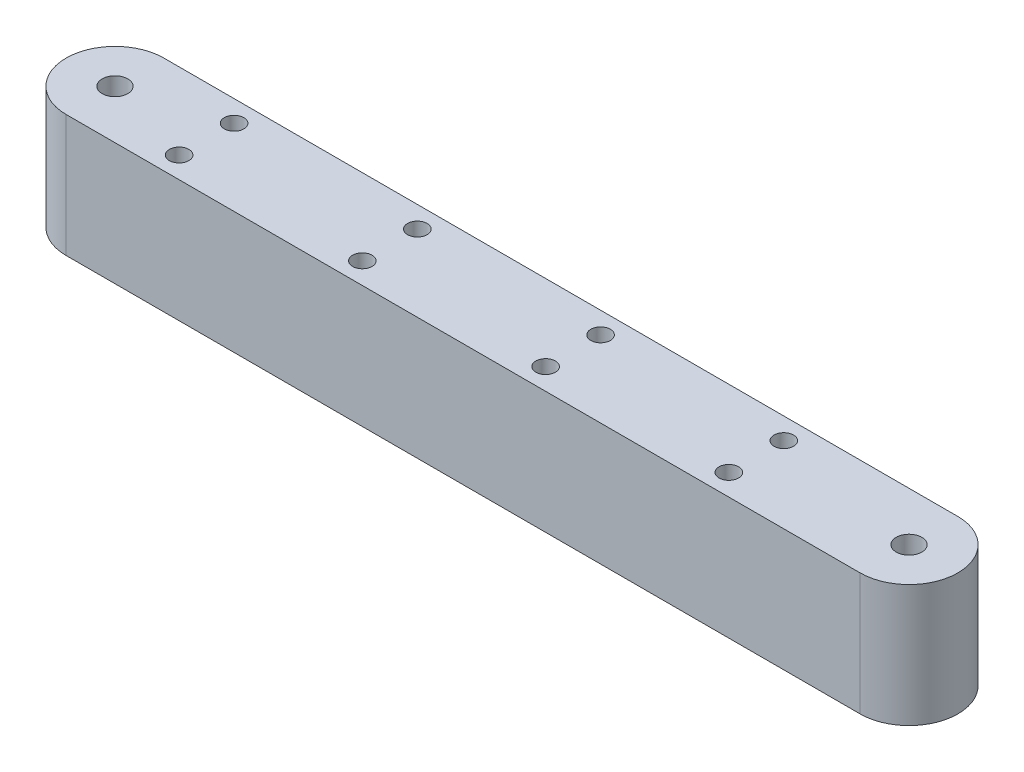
ISO-10303-21;
HEADER;
FILE_DESCRIPTION(('STEP AP214'),'2;1');
FILE_NAME('part.step','',(''),(''),'','','');
FILE_SCHEMA(('AUTOMOTIVE_DESIGN { 1 0 10303 214 1 1 1 1 }'));
ENDSEC;
DATA;
#1=APPLICATION_CONTEXT('core data for automotive mechanical design processes');
#2=APPLICATION_PROTOCOL_DEFINITION('international standard','automotive_design',2000,#1);
#3=PRODUCT_CONTEXT('',#1,'mechanical');
#4=PRODUCT('Part','Part','',(#3));
#5=PRODUCT_RELATED_PRODUCT_CATEGORY('part','',(#4));
#6=PRODUCT_DEFINITION_FORMATION('','',#4);
#7=PRODUCT_DEFINITION_CONTEXT('part definition',#1,'design');
#8=PRODUCT_DEFINITION('design','',#6,#7);
#9=PRODUCT_DEFINITION_SHAPE('','',#8);
#10=(LENGTH_UNIT() NAMED_UNIT(*) SI_UNIT(.MILLI.,.METRE.));
#11=(NAMED_UNIT(*) PLANE_ANGLE_UNIT() SI_UNIT($,.RADIAN.));
#12=(NAMED_UNIT(*) SI_UNIT($,.STERADIAN.) SOLID_ANGLE_UNIT());
#13=UNCERTAINTY_MEASURE_WITH_UNIT(LENGTH_MEASURE(1.E-05),#10,'distance_accuracy_value','');
#14=(GEOMETRIC_REPRESENTATION_CONTEXT(3) GLOBAL_UNCERTAINTY_ASSIGNED_CONTEXT((#13)) GLOBAL_UNIT_ASSIGNED_CONTEXT((#10,
#11,#12)) REPRESENTATION_CONTEXT('',''));
#15=CARTESIAN_POINT('',(0.,0.,0.));
#16=DIRECTION('',(0.,0.,1.));
#17=DIRECTION('',(1.,0.,0.));
#18=AXIS2_PLACEMENT_3D('',#15,#16,#17);
#19=CARTESIAN_POINT('',(-65.,20.,0.));
#20=DIRECTION('',(0.,1.,0.));
#21=DIRECTION('',(0.,0.,1.));
#22=AXIS2_PLACEMENT_3D('',#19,#20,#21);
#23=PLANE('',#22);
#24=CARTESIAN_POINT('',(-19.9999999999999,20.,4.49999999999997));
#25=DIRECTION('',(0.,1.,0.));
#26=DIRECTION('',(0.,0.,1.));
#27=AXIS2_PLACEMENT_3D('',#24,#25,#26);
#28=CIRCLE('',#27,1.6);
#29=CARTESIAN_POINT('',(-19.9999999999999,20.,6.09999999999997));
#30=VERTEX_POINT('',#29);
#31=EDGE_CURVE('E153',#30,#30,#28,.T.);
#32=ORIENTED_EDGE('',*,*,#31,.F.);
#33=EDGE_LOOP('',(#32));
#34=FACE_BOUND('',#33,.T.);
#35=CARTESIAN_POINT('',(40.,20.,-4.50000000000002));
#36=DIRECTION('',(0.,1.,0.));
#37=DIRECTION('',(0.,0.,1.));
#38=AXIS2_PLACEMENT_3D('',#35,#36,#37);
#39=CIRCLE('',#38,1.59999999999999);
#40=CARTESIAN_POINT('',(40.,20.,-2.90000000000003));
#41=VERTEX_POINT('',#40);
#42=EDGE_CURVE('E142',#41,#41,#39,.T.);
#43=ORIENTED_EDGE('',*,*,#42,.F.);
#44=EDGE_LOOP('',(#43));
#45=FACE_BOUND('',#44,.T.);
#46=CARTESIAN_POINT('',(9.99999999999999,20.,-4.50000000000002));
#47=DIRECTION('',(0.,1.,0.));
#48=DIRECTION('',(0.,0.,1.));
#49=AXIS2_PLACEMENT_3D('',#46,#47,#48);
#50=CIRCLE('',#49,1.6);
#51=CARTESIAN_POINT('',(9.99999999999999,20.,-2.90000000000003));
#52=VERTEX_POINT('',#51);
#53=EDGE_CURVE('E141',#52,#52,#50,.T.);
#54=ORIENTED_EDGE('',*,*,#53,.F.);
#55=EDGE_LOOP('',(#54));
#56=FACE_BOUND('',#55,.T.);
#57=CARTESIAN_POINT('',(-20.,20.,-4.50000000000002));
#58=DIRECTION('',(0.,1.,0.));
#59=DIRECTION('',(0.,0.,1.));
#60=AXIS2_PLACEMENT_3D('',#57,#58,#59);
#61=CIRCLE('',#60,1.6);
#62=CARTESIAN_POINT('',(-20.,20.,-2.90000000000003));
#63=VERTEX_POINT('',#62);
#64=EDGE_CURVE('E135',#63,#63,#61,.T.);
#65=ORIENTED_EDGE('',*,*,#64,.F.);
#66=EDGE_LOOP('',(#65));
#67=FACE_BOUND('',#66,.T.);
#68=CARTESIAN_POINT('',(10.0000000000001,20.,4.49999999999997));
#69=DIRECTION('',(0.,1.,0.));
#70=DIRECTION('',(0.,0.,1.));
#71=AXIS2_PLACEMENT_3D('',#68,#69,#70);
#72=CIRCLE('',#71,1.6);
#73=CARTESIAN_POINT('',(10.0000000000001,20.,6.09999999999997));
#74=VERTEX_POINT('',#73);
#75=EDGE_CURVE('E154',#74,#74,#72,.T.);
#76=ORIENTED_EDGE('',*,*,#75,.F.);
#77=EDGE_LOOP('',(#76));
#78=FACE_BOUND('',#77,.T.);
#79=CARTESIAN_POINT('',(40.0000000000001,20.,4.49999999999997));
#80=DIRECTION('',(0.,1.,0.));
#81=DIRECTION('',(0.,0.,1.));
#82=AXIS2_PLACEMENT_3D('',#79,#80,#81);
#83=CIRCLE('',#82,1.60000000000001);
#84=CARTESIAN_POINT('',(40.0000000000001,20.,6.09999999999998));
#85=VERTEX_POINT('',#84);
#86=EDGE_CURVE('E171',#85,#85,#83,.T.);
#87=ORIENTED_EDGE('',*,*,#86,.F.);
#88=EDGE_LOOP('',(#87));
#89=FACE_BOUND('',#88,.T.);
#90=CARTESIAN_POINT('',(-49.9999999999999,20.,4.49999999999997));
#91=DIRECTION('',(0.,1.,0.));
#92=DIRECTION('',(0.,0.,1.));
#93=AXIS2_PLACEMENT_3D('',#90,#91,#92);
#94=CIRCLE('',#93,1.6);
#95=CARTESIAN_POINT('',(-49.9999999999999,20.,6.09999999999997));
#96=VERTEX_POINT('',#95);
#97=EDGE_CURVE('E165',#96,#96,#94,.T.);
#98=ORIENTED_EDGE('',*,*,#97,.F.);
#99=EDGE_LOOP('',(#98));
#100=FACE_BOUND('',#99,.T.);
#101=CARTESIAN_POINT('',(-50.,20.,-4.50000000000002));
#102=DIRECTION('',(0.,1.,0.));
#103=DIRECTION('',(0.,0.,1.));
#104=AXIS2_PLACEMENT_3D('',#101,#102,#103);
#105=CIRCLE('',#104,1.6);
#106=CARTESIAN_POINT('',(-50.,20.,-2.90000000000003));
#107=VERTEX_POINT('',#106);
#108=EDGE_CURVE('E132',#107,#107,#105,.T.);
#109=ORIENTED_EDGE('',*,*,#108,.F.);
#110=EDGE_LOOP('',(#109));
#111=FACE_BOUND('',#110,.T.);
#112=CARTESIAN_POINT('',(-65.,20.,0.));
#113=DIRECTION('',(0.,1.,0.));
#114=DIRECTION('',(0.,0.,1.));
#115=AXIS2_PLACEMENT_3D('',#112,#113,#114);
#116=CIRCLE('',#115,2.1);
#117=CARTESIAN_POINT('',(-65.,20.,2.1));
#118=VERTEX_POINT('',#117);
#119=EDGE_CURVE('E108',#118,#118,#116,.T.);
#120=ORIENTED_EDGE('',*,*,#119,.F.);
#121=EDGE_LOOP('',(#120));
#122=FACE_BOUND('',#121,.T.);
#123=CARTESIAN_POINT('',(-65.,20.,0.));
#124=DIRECTION('',(0.,1.,0.));
#125=DIRECTION('',(0.,0.,1.));
#126=AXIS2_PLACEMENT_3D('',#123,#124,#125);
#127=CIRCLE('',#126,8.);
#128=CARTESIAN_POINT('',(-65.,20.,-8.));
#129=VERTEX_POINT('',#128);
#130=CARTESIAN_POINT('',(-65.,20.,8.));
#131=VERTEX_POINT('',#130);
#132=EDGE_CURVE('E93',#129,#131,#127,.T.);
#133=ORIENTED_EDGE('',*,*,#132,.T.);
#134=DIRECTION('',(1.,0.,0.));
#135=VECTOR('',#134,1.);
#136=CARTESIAN_POINT('',(-65.,20.,8.));
#137=LINE('',#136,#135);
#138=CARTESIAN_POINT('',(65.,20.,7.99999999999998));
#139=VERTEX_POINT('',#138);
#140=EDGE_CURVE('E88',#131,#139,#137,.T.);
#141=ORIENTED_EDGE('',*,*,#140,.T.);
#142=CARTESIAN_POINT('',(65.,20.,0.));
#143=DIRECTION('',(0.,1.,0.));
#144=DIRECTION('',(0.,0.,1.));
#145=AXIS2_PLACEMENT_3D('',#142,#143,#144);
#146=CIRCLE('',#145,8.);
#147=CARTESIAN_POINT('',(65.,20.,-8.00000000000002));
#148=VERTEX_POINT('',#147);
#149=EDGE_CURVE('E91',#139,#148,#146,.T.);
#150=ORIENTED_EDGE('',*,*,#149,.T.);
#151=DIRECTION('',(-1.,0.,0.));
#152=VECTOR('',#151,1.);
#153=CARTESIAN_POINT('',(-65.,20.,-8.));
#154=LINE('',#153,#152);
#155=EDGE_CURVE('E58',#148,#129,#154,.T.);
#156=ORIENTED_EDGE('',*,*,#155,.T.);
#157=EDGE_LOOP('',(#133,#141,#150,#156));
#158=FACE_BOUND('',#157,.T.);
#159=CARTESIAN_POINT('',(65.,20.,0.));
#160=DIRECTION('',(0.,1.,0.));
#161=DIRECTION('',(0.,0.,1.));
#162=AXIS2_PLACEMENT_3D('',#159,#160,#161);
#163=CIRCLE('',#162,2.1);
#164=CARTESIAN_POINT('',(65.,20.,2.09999999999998));
#165=VERTEX_POINT('',#164);
#166=EDGE_CURVE('E123',#165,#165,#163,.T.);
#167=ORIENTED_EDGE('',*,*,#166,.F.);
#168=EDGE_LOOP('',(#167));
#169=FACE_BOUND('',#168,.T.);
#170=ADVANCED_FACE('F41',(#34,#45,#56,#67,#78,#89,#100,#111,#122,#158,#169),#23,.T.);
#171=CARTESIAN_POINT('',(-65.,0.,0.));
#172=DIRECTION('',(0.,1.,0.));
#173=DIRECTION('',(0.,0.,1.));
#174=AXIS2_PLACEMENT_3D('',#171,#172,#173);
#175=PLANE('',#174);
#176=CARTESIAN_POINT('',(-19.9999999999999,0.,4.49999999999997));
#177=DIRECTION('',(0.,1.,0.));
#178=DIRECTION('',(0.,0.,1.));
#179=AXIS2_PLACEMENT_3D('',#176,#177,#178);
#180=CIRCLE('',#179,1.6);
#181=CARTESIAN_POINT('',(-19.9999999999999,0.,6.09999999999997));
#182=VERTEX_POINT('',#181);
#183=EDGE_CURVE('E150',#182,#182,#180,.T.);
#184=ORIENTED_EDGE('',*,*,#183,.T.);
#185=EDGE_LOOP('',(#184));
#186=FACE_BOUND('',#185,.T.);
#187=CARTESIAN_POINT('',(40.,0.,-4.50000000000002));
#188=DIRECTION('',(0.,1.,0.));
#189=DIRECTION('',(0.,0.,1.));
#190=AXIS2_PLACEMENT_3D('',#187,#188,#189);
#191=CIRCLE('',#190,1.59999999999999);
#192=CARTESIAN_POINT('',(40.,0.,-2.90000000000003));
#193=VERTEX_POINT('',#192);
#194=EDGE_CURVE('E157',#193,#193,#191,.T.);
#195=ORIENTED_EDGE('',*,*,#194,.T.);
#196=EDGE_LOOP('',(#195));
#197=FACE_BOUND('',#196,.T.);
#198=CARTESIAN_POINT('',(9.99999999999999,0.,-4.50000000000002));
#199=DIRECTION('',(0.,1.,0.));
#200=DIRECTION('',(0.,0.,1.));
#201=AXIS2_PLACEMENT_3D('',#198,#199,#200);
#202=CIRCLE('',#201,1.6);
#203=CARTESIAN_POINT('',(9.99999999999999,0.,-2.90000000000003));
#204=VERTEX_POINT('',#203);
#205=EDGE_CURVE('E138',#204,#204,#202,.T.);
#206=ORIENTED_EDGE('',*,*,#205,.T.);
#207=EDGE_LOOP('',(#206));
#208=FACE_BOUND('',#207,.T.);
#209=CARTESIAN_POINT('',(-20.,0.,-4.50000000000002));
#210=DIRECTION('',(0.,1.,0.));
#211=DIRECTION('',(0.,0.,1.));
#212=AXIS2_PLACEMENT_3D('',#209,#210,#211);
#213=CIRCLE('',#212,1.6);
#214=CARTESIAN_POINT('',(-20.,0.,-2.90000000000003));
#215=VERTEX_POINT('',#214);
#216=EDGE_CURVE('E145',#215,#215,#213,.T.);
#217=ORIENTED_EDGE('',*,*,#216,.T.);
#218=EDGE_LOOP('',(#217));
#219=FACE_BOUND('',#218,.T.);
#220=CARTESIAN_POINT('',(10.0000000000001,0.,4.49999999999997));
#221=DIRECTION('',(0.,1.,0.));
#222=DIRECTION('',(0.,0.,1.));
#223=AXIS2_PLACEMENT_3D('',#220,#221,#222);
#224=CIRCLE('',#223,1.6);
#225=CARTESIAN_POINT('',(10.0000000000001,0.,6.09999999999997));
#226=VERTEX_POINT('',#225);
#227=EDGE_CURVE('E174',#226,#226,#224,.T.);
#228=ORIENTED_EDGE('',*,*,#227,.T.);
#229=EDGE_LOOP('',(#228));
#230=FACE_BOUND('',#229,.T.);
#231=CARTESIAN_POINT('',(40.0000000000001,0.,4.49999999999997));
#232=DIRECTION('',(0.,1.,0.));
#233=DIRECTION('',(0.,0.,1.));
#234=AXIS2_PLACEMENT_3D('',#231,#232,#233);
#235=CIRCLE('',#234,1.60000000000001);
#236=CARTESIAN_POINT('',(40.0000000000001,0.,6.09999999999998));
#237=VERTEX_POINT('',#236);
#238=EDGE_CURVE('E168',#237,#237,#235,.T.);
#239=ORIENTED_EDGE('',*,*,#238,.T.);
#240=EDGE_LOOP('',(#239));
#241=FACE_BOUND('',#240,.T.);
#242=CARTESIAN_POINT('',(-49.9999999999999,0.,4.49999999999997));
#243=DIRECTION('',(0.,1.,0.));
#244=DIRECTION('',(0.,0.,1.));
#245=AXIS2_PLACEMENT_3D('',#242,#243,#244);
#246=CIRCLE('',#245,1.6);
#247=CARTESIAN_POINT('',(-49.9999999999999,0.,6.09999999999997));
#248=VERTEX_POINT('',#247);
#249=EDGE_CURVE('E162',#248,#248,#246,.T.);
#250=ORIENTED_EDGE('',*,*,#249,.T.);
#251=EDGE_LOOP('',(#250));
#252=FACE_BOUND('',#251,.T.);
#253=CARTESIAN_POINT('',(-50.,0.,-4.50000000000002));
#254=DIRECTION('',(0.,1.,0.));
#255=DIRECTION('',(0.,0.,1.));
#256=AXIS2_PLACEMENT_3D('',#253,#254,#255);
#257=CIRCLE('',#256,1.6);
#258=CARTESIAN_POINT('',(-50.,0.,-2.90000000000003));
#259=VERTEX_POINT('',#258);
#260=EDGE_CURVE('E129',#259,#259,#257,.T.);
#261=ORIENTED_EDGE('',*,*,#260,.T.);
#262=EDGE_LOOP('',(#261));
#263=FACE_BOUND('',#262,.T.);
#264=CARTESIAN_POINT('',(-65.,0.,0.));
#265=DIRECTION('',(0.,1.,0.));
#266=DIRECTION('',(0.,0.,1.));
#267=AXIS2_PLACEMENT_3D('',#264,#265,#266);
#268=CIRCLE('',#267,8.);
#269=CARTESIAN_POINT('',(-65.,0.,-8.));
#270=VERTEX_POINT('',#269);
#271=CARTESIAN_POINT('',(-65.,0.,8.));
#272=VERTEX_POINT('',#271);
#273=EDGE_CURVE('E105',#270,#272,#268,.T.);
#274=ORIENTED_EDGE('',*,*,#273,.F.);
#275=DIRECTION('',(-1.,0.,0.));
#276=VECTOR('',#275,1.);
#277=CARTESIAN_POINT('',(-65.,0.,-8.));
#278=LINE('',#277,#276);
#279=CARTESIAN_POINT('',(65.,0.,-8.00000000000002));
#280=VERTEX_POINT('',#279);
#281=EDGE_CURVE('E81',#280,#270,#278,.T.);
#282=ORIENTED_EDGE('',*,*,#281,.F.);
#283=CARTESIAN_POINT('',(65.,0.,0.));
#284=DIRECTION('',(0.,1.,0.));
#285=DIRECTION('',(0.,0.,1.));
#286=AXIS2_PLACEMENT_3D('',#283,#284,#285);
#287=CIRCLE('',#286,8.);
#288=CARTESIAN_POINT('',(65.,0.,7.99999999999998));
#289=VERTEX_POINT('',#288);
#290=EDGE_CURVE('E75',#289,#280,#287,.T.);
#291=ORIENTED_EDGE('',*,*,#290,.F.);
#292=DIRECTION('',(1.,0.,0.));
#293=VECTOR('',#292,1.);
#294=CARTESIAN_POINT('',(-65.,0.,8.));
#295=LINE('',#294,#293);
#296=EDGE_CURVE('E97',#272,#289,#295,.T.);
#297=ORIENTED_EDGE('',*,*,#296,.F.);
#298=EDGE_LOOP('',(#274,#282,#291,#297));
#299=FACE_BOUND('',#298,.T.);
#300=CARTESIAN_POINT('',(-65.,0.,0.));
#301=DIRECTION('',(0.,1.,0.));
#302=DIRECTION('',(0.,0.,1.));
#303=AXIS2_PLACEMENT_3D('',#300,#301,#302);
#304=CIRCLE('',#303,2.1);
#305=CARTESIAN_POINT('',(-65.,0.,2.1));
#306=VERTEX_POINT('',#305);
#307=EDGE_CURVE('E120',#306,#306,#304,.T.);
#308=ORIENTED_EDGE('',*,*,#307,.T.);
#309=EDGE_LOOP('',(#308));
#310=FACE_BOUND('',#309,.T.);
#311=CARTESIAN_POINT('',(65.,0.,0.));
#312=DIRECTION('',(0.,1.,0.));
#313=DIRECTION('',(0.,0.,1.));
#314=AXIS2_PLACEMENT_3D('',#311,#312,#313);
#315=CIRCLE('',#314,2.1);
#316=CARTESIAN_POINT('',(65.,0.,2.09999999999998));
#317=VERTEX_POINT('',#316);
#318=EDGE_CURVE('E126',#317,#317,#315,.T.);
#319=ORIENTED_EDGE('',*,*,#318,.T.);
#320=EDGE_LOOP('',(#319));
#321=FACE_BOUND('',#320,.T.);
#322=ADVANCED_FACE('F116',(#186,#197,#208,#219,#230,#241,#252,#263,#299,#310,#321),#175,.F.);
#323=CARTESIAN_POINT('',(-65.,20.,0.));
#324=DIRECTION('',(0.,-1.,0.));
#325=DIRECTION('',(0.,0.,-1.));
#326=AXIS2_PLACEMENT_3D('',#323,#324,#325);
#327=CYLINDRICAL_SURFACE('',#326,8.);
#328=ORIENTED_EDGE('',*,*,#273,.T.);
#329=DIRECTION('',(0.,-1.,0.));
#330=VECTOR('',#329,1.);
#331=CARTESIAN_POINT('',(-65.,20.,8.));
#332=LINE('',#331,#330);
#333=EDGE_CURVE('E11',#131,#272,#332,.T.);
#334=ORIENTED_EDGE('',*,*,#333,.F.);
#335=ORIENTED_EDGE('',*,*,#132,.F.);
#336=DIRECTION('',(0.,-1.,0.));
#337=VECTOR('',#336,1.);
#338=CARTESIAN_POINT('',(-65.,20.,-8.));
#339=LINE('',#338,#337);
#340=EDGE_CURVE('E101',#129,#270,#339,.T.);
#341=ORIENTED_EDGE('',*,*,#340,.T.);
#342=EDGE_LOOP('',(#328,#334,#335,#341));
#343=FACE_BOUND('',#342,.T.);
#344=ADVANCED_FACE('F43',(#343),#327,.T.);
#345=CARTESIAN_POINT('',(-65.,20.,8.));
#346=DIRECTION('',(0.,0.,-1.));
#347=DIRECTION('',(-1.,0.,0.));
#348=AXIS2_PLACEMENT_3D('',#345,#346,#347);
#349=PLANE('',#348);
#350=ORIENTED_EDGE('',*,*,#296,.T.);
#351=DIRECTION('',(0.,-1.,0.));
#352=VECTOR('',#351,1.);
#353=CARTESIAN_POINT('',(65.,20.,7.99999999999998));
#354=LINE('',#353,#352);
#355=EDGE_CURVE('E50',#139,#289,#354,.T.);
#356=ORIENTED_EDGE('',*,*,#355,.F.);
#357=ORIENTED_EDGE('',*,*,#140,.F.);
#358=ORIENTED_EDGE('',*,*,#333,.T.);
#359=EDGE_LOOP('',(#350,#356,#357,#358));
#360=FACE_BOUND('',#359,.T.);
#361=ADVANCED_FACE('F96',(#360),#349,.F.);
#362=CARTESIAN_POINT('',(65.,20.,0.));
#363=DIRECTION('',(0.,-1.,0.));
#364=DIRECTION('',(0.,0.,-1.));
#365=AXIS2_PLACEMENT_3D('',#362,#363,#364);
#366=CYLINDRICAL_SURFACE('',#365,8.);
#367=ORIENTED_EDGE('',*,*,#290,.T.);
#368=DIRECTION('',(0.,-1.,0.));
#369=VECTOR('',#368,1.);
#370=CARTESIAN_POINT('',(65.,20.,-8.00000000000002));
#371=LINE('',#370,#369);
#372=EDGE_CURVE('E98',#148,#280,#371,.T.);
#373=ORIENTED_EDGE('',*,*,#372,.F.);
#374=ORIENTED_EDGE('',*,*,#149,.F.);
#375=ORIENTED_EDGE('',*,*,#355,.T.);
#376=EDGE_LOOP('',(#367,#373,#374,#375));
#377=FACE_BOUND('',#376,.T.);
#378=ADVANCED_FACE('F99',(#377),#366,.T.);
#379=CARTESIAN_POINT('',(-65.,20.,-8.));
#380=DIRECTION('',(0.,0.,1.));
#381=DIRECTION('',(1.,0.,0.));
#382=AXIS2_PLACEMENT_3D('',#379,#380,#381);
#383=PLANE('',#382);
#384=ORIENTED_EDGE('',*,*,#281,.T.);
#385=ORIENTED_EDGE('',*,*,#340,.F.);
#386=ORIENTED_EDGE('',*,*,#155,.F.);
#387=ORIENTED_EDGE('',*,*,#372,.T.);
#388=EDGE_LOOP('',(#384,#385,#386,#387));
#389=FACE_BOUND('',#388,.T.);
#390=ADVANCED_FACE('F113',(#389),#383,.F.);
#391=CARTESIAN_POINT('',(-65.,20.,0.));
#392=DIRECTION('',(0.,-1.,0.));
#393=DIRECTION('',(0.,0.,-1.));
#394=AXIS2_PLACEMENT_3D('',#391,#392,#393);
#395=CYLINDRICAL_SURFACE('',#394,2.1);
#396=ORIENTED_EDGE('',*,*,#119,.T.);
#397=EDGE_LOOP('',(#396));
#398=FACE_BOUND('',#397,.T.);
#399=ORIENTED_EDGE('',*,*,#307,.F.);
#400=EDGE_LOOP('',(#399));
#401=FACE_BOUND('',#400,.T.);
#402=ADVANCED_FACE('F194',(#398,#401),#395,.F.);
#403=CARTESIAN_POINT('',(65.,20.,0.));
#404=DIRECTION('',(0.,-1.,0.));
#405=DIRECTION('',(0.,0.,-1.));
#406=AXIS2_PLACEMENT_3D('',#403,#404,#405);
#407=CYLINDRICAL_SURFACE('',#406,2.1);
#408=ORIENTED_EDGE('',*,*,#166,.T.);
#409=EDGE_LOOP('',(#408));
#410=FACE_BOUND('',#409,.T.);
#411=ORIENTED_EDGE('',*,*,#318,.F.);
#412=EDGE_LOOP('',(#411));
#413=FACE_BOUND('',#412,.T.);
#414=ADVANCED_FACE('F197',(#410,#413),#407,.F.);
#415=CARTESIAN_POINT('',(-50.,0.,-4.50000000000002));
#416=DIRECTION('',(0.,1.,0.));
#417=DIRECTION('',(0.,0.,1.));
#418=AXIS2_PLACEMENT_3D('',#415,#416,#417);
#419=CYLINDRICAL_SURFACE('',#418,1.6);
#420=ORIENTED_EDGE('',*,*,#260,.F.);
#421=EDGE_LOOP('',(#420));
#422=FACE_BOUND('',#421,.T.);
#423=ORIENTED_EDGE('',*,*,#108,.T.);
#424=EDGE_LOOP('',(#423));
#425=FACE_BOUND('',#424,.T.);
#426=ADVANCED_FACE('F207',(#422,#425),#419,.F.);
#427=CARTESIAN_POINT('',(-49.9999999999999,0.,4.49999999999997));
#428=DIRECTION('',(0.,1.,0.));
#429=DIRECTION('',(0.,0.,1.));
#430=AXIS2_PLACEMENT_3D('',#427,#428,#429);
#431=CYLINDRICAL_SURFACE('',#430,1.6);
#432=ORIENTED_EDGE('',*,*,#249,.F.);
#433=EDGE_LOOP('',(#432));
#434=FACE_BOUND('',#433,.T.);
#435=ORIENTED_EDGE('',*,*,#97,.T.);
#436=EDGE_LOOP('',(#435));
#437=FACE_BOUND('',#436,.T.);
#438=ADVANCED_FACE('F213',(#434,#437),#431,.F.);
#439=CARTESIAN_POINT('',(40.0000000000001,0.,4.49999999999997));
#440=DIRECTION('',(0.,1.,0.));
#441=DIRECTION('',(0.,0.,1.));
#442=AXIS2_PLACEMENT_3D('',#439,#440,#441);
#443=CYLINDRICAL_SURFACE('',#442,1.60000000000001);
#444=ORIENTED_EDGE('',*,*,#238,.F.);
#445=EDGE_LOOP('',(#444));
#446=FACE_BOUND('',#445,.T.);
#447=ORIENTED_EDGE('',*,*,#86,.T.);
#448=EDGE_LOOP('',(#447));
#449=FACE_BOUND('',#448,.T.);
#450=ADVANCED_FACE('F274',(#446,#449),#443,.F.);
#451=CARTESIAN_POINT('',(10.0000000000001,0.,4.49999999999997));
#452=DIRECTION('',(0.,1.,0.));
#453=DIRECTION('',(0.,0.,1.));
#454=AXIS2_PLACEMENT_3D('',#451,#452,#453);
#455=CYLINDRICAL_SURFACE('',#454,1.6);
#456=ORIENTED_EDGE('',*,*,#227,.F.);
#457=EDGE_LOOP('',(#456));
#458=FACE_BOUND('',#457,.T.);
#459=ORIENTED_EDGE('',*,*,#75,.T.);
#460=EDGE_LOOP('',(#459));
#461=FACE_BOUND('',#460,.T.);
#462=ADVANCED_FACE('F180',(#458,#461),#455,.F.);
#463=CARTESIAN_POINT('',(-20.,0.,-4.50000000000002));
#464=DIRECTION('',(0.,1.,0.));
#465=DIRECTION('',(0.,0.,1.));
#466=AXIS2_PLACEMENT_3D('',#463,#464,#465);
#467=CYLINDRICAL_SURFACE('',#466,1.6);
#468=ORIENTED_EDGE('',*,*,#216,.F.);
#469=EDGE_LOOP('',(#468));
#470=FACE_BOUND('',#469,.T.);
#471=ORIENTED_EDGE('',*,*,#64,.T.);
#472=EDGE_LOOP('',(#471));
#473=FACE_BOUND('',#472,.T.);
#474=ADVANCED_FACE('F293',(#470,#473),#467,.F.);
#475=CARTESIAN_POINT('',(9.99999999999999,0.,-4.50000000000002));
#476=DIRECTION('',(0.,1.,0.));
#477=DIRECTION('',(0.,0.,1.));
#478=AXIS2_PLACEMENT_3D('',#475,#476,#477);
#479=CYLINDRICAL_SURFACE('',#478,1.6);
#480=ORIENTED_EDGE('',*,*,#205,.F.);
#481=EDGE_LOOP('',(#480));
#482=FACE_BOUND('',#481,.T.);
#483=ORIENTED_EDGE('',*,*,#53,.T.);
#484=EDGE_LOOP('',(#483));
#485=FACE_BOUND('',#484,.T.);
#486=ADVANCED_FACE('F303',(#482,#485),#479,.F.);
#487=CARTESIAN_POINT('',(40.,0.,-4.50000000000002));
#488=DIRECTION('',(0.,1.,0.));
#489=DIRECTION('',(0.,0.,1.));
#490=AXIS2_PLACEMENT_3D('',#487,#488,#489);
#491=CYLINDRICAL_SURFACE('',#490,1.59999999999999);
#492=ORIENTED_EDGE('',*,*,#194,.F.);
#493=EDGE_LOOP('',(#492));
#494=FACE_BOUND('',#493,.T.);
#495=ORIENTED_EDGE('',*,*,#42,.T.);
#496=EDGE_LOOP('',(#495));
#497=FACE_BOUND('',#496,.T.);
#498=ADVANCED_FACE('F313',(#494,#497),#491,.F.);
#499=CARTESIAN_POINT('',(-19.9999999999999,0.,4.49999999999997));
#500=DIRECTION('',(0.,1.,0.));
#501=DIRECTION('',(0.,0.,1.));
#502=AXIS2_PLACEMENT_3D('',#499,#500,#501);
#503=CYLINDRICAL_SURFACE('',#502,1.6);
#504=ORIENTED_EDGE('',*,*,#183,.F.);
#505=EDGE_LOOP('',(#504));
#506=FACE_BOUND('',#505,.T.);
#507=ORIENTED_EDGE('',*,*,#31,.T.);
#508=EDGE_LOOP('',(#507));
#509=FACE_BOUND('',#508,.T.);
#510=ADVANCED_FACE('F322',(#506,#509),#503,.F.);
#511=CLOSED_SHELL('',(#170,#322,#344,#361,#378,#390,#402,#414,#426,#438,#450,#462,#474,#486,
#498,#510));
#512=MANIFOLD_SOLID_BREP('B2',#511);
#513=ADVANCED_BREP_SHAPE_REPRESENTATION('',(#18,#512),#14);
#514=SHAPE_DEFINITION_REPRESENTATION(#9,#513);
ENDSEC;
END-ISO-10303-21;
